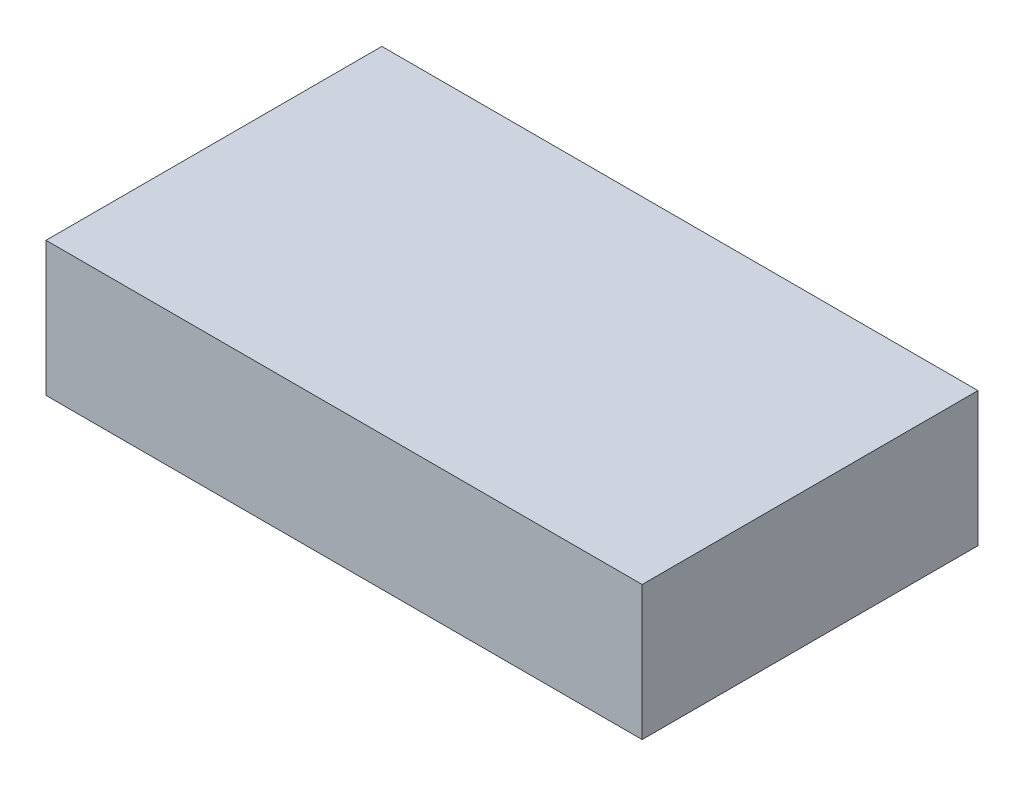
from build123d import *

# Parameters (mm, degrees)
SKETCH_1_W      = 35.5
SKETCH_1_H      = 20
EXTRUDE_1_DEPTH = 8


with BuildPart() as part:
    # Sketch 1 → Extrude 1 (new body)
    with BuildSketch(Plane(origin=(0, 0, 0), x_dir=(1, 0, 0), z_dir=(0, 1, 0))):
        with Locations((1.793322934, -2.490362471)):
            Rectangle(SKETCH_1_W, SKETCH_1_H)
    extrude(amount=EXTRUDE_1_DEPTH)


solid = part.part
